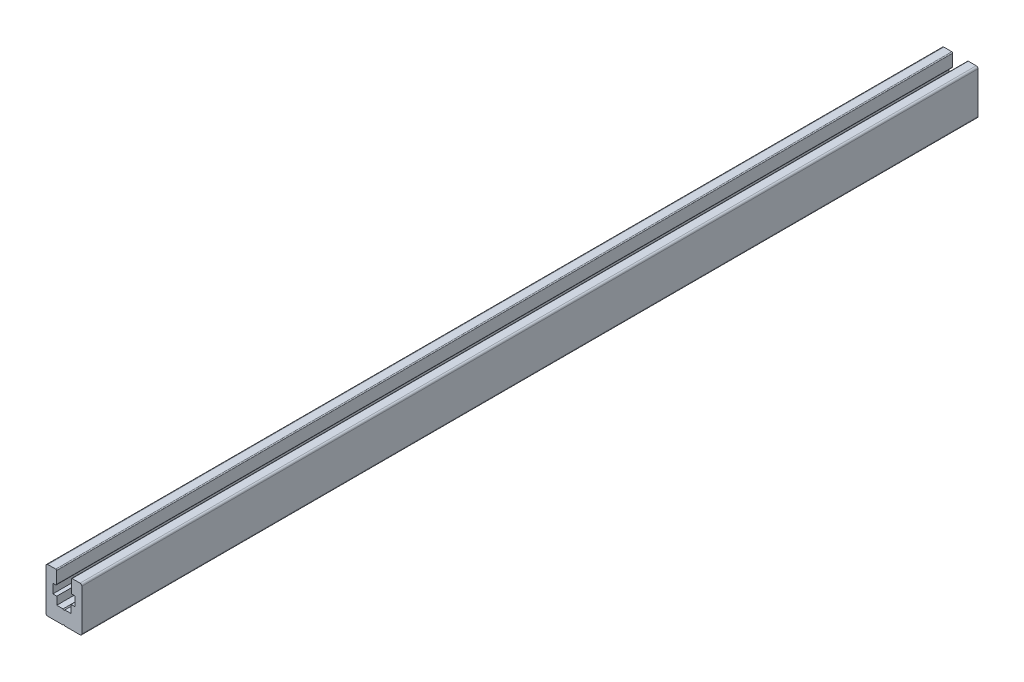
ISO-10303-21;
HEADER;
FILE_DESCRIPTION(('STEP AP214'),'2;1');
FILE_NAME('part.step','',(''),(''),'','','');
FILE_SCHEMA(('AUTOMOTIVE_DESIGN { 1 0 10303 214 1 1 1 1 }'));
ENDSEC;
DATA;
#1=APPLICATION_CONTEXT('core data for automotive mechanical design processes');
#2=APPLICATION_PROTOCOL_DEFINITION('international standard','automotive_design',2000,#1);
#3=PRODUCT_CONTEXT('',#1,'mechanical');
#4=PRODUCT('Part','Part','',(#3));
#5=PRODUCT_RELATED_PRODUCT_CATEGORY('part','',(#4));
#6=PRODUCT_DEFINITION_FORMATION('','',#4);
#7=PRODUCT_DEFINITION_CONTEXT('part definition',#1,'design');
#8=PRODUCT_DEFINITION('design','',#6,#7);
#9=PRODUCT_DEFINITION_SHAPE('','',#8);
#10=(LENGTH_UNIT() NAMED_UNIT(*) SI_UNIT(.MILLI.,.METRE.));
#11=(NAMED_UNIT(*) PLANE_ANGLE_UNIT() SI_UNIT($,.RADIAN.));
#12=(NAMED_UNIT(*) SI_UNIT($,.STERADIAN.) SOLID_ANGLE_UNIT());
#13=UNCERTAINTY_MEASURE_WITH_UNIT(LENGTH_MEASURE(1.E-05),#10,'distance_accuracy_value','');
#14=(GEOMETRIC_REPRESENTATION_CONTEXT(3) GLOBAL_UNCERTAINTY_ASSIGNED_CONTEXT((#13)) GLOBAL_UNIT_ASSIGNED_CONTEXT((#10,
#11,#12)) REPRESENTATION_CONTEXT('',''));
#15=CARTESIAN_POINT('',(0.,0.,0.));
#16=DIRECTION('',(0.,0.,1.));
#17=DIRECTION('',(1.,0.,0.));
#18=AXIS2_PLACEMENT_3D('',#15,#16,#17);
#19=CARTESIAN_POINT('',(-0.5,0.,500.));
#20=DIRECTION('',(0.,-1.,0.));
#21=DIRECTION('',(0.,0.,1.));
#22=AXIS2_PLACEMENT_3D('',#19,#20,#21);
#23=PLANE('',#22);
#24=DIRECTION('',(-1.,0.,0.));
#25=VECTOR('',#24,1.);
#26=CARTESIAN_POINT('',(-0.5,0.,500.));
#27=LINE('',#26,#25);
#28=CARTESIAN_POINT('',(-0.5,0.,500.));
#29=VERTEX_POINT('',#28);
#30=CARTESIAN_POINT('',(-9.,0.,500.));
#31=VERTEX_POINT('',#30);
#32=EDGE_CURVE('E285',#29,#31,#27,.T.);
#33=ORIENTED_EDGE('',*,*,#32,.T.);
#34=DIRECTION('',(0.,0.,-1.));
#35=VECTOR('',#34,1.);
#36=CARTESIAN_POINT('',(-9.,0.,500.));
#37=LINE('',#36,#35);
#38=CARTESIAN_POINT('',(-9.,0.,0.));
#39=VERTEX_POINT('',#38);
#40=EDGE_CURVE('E406',#31,#39,#37,.T.);
#41=ORIENTED_EDGE('',*,*,#40,.T.);
#42=DIRECTION('',(-1.,0.,0.));
#43=VECTOR('',#42,1.);
#44=CARTESIAN_POINT('',(-0.5,0.,0.));
#45=LINE('',#44,#43);
#46=CARTESIAN_POINT('',(-0.5,0.,0.));
#47=VERTEX_POINT('',#46);
#48=EDGE_CURVE('E534',#47,#39,#45,.T.);
#49=ORIENTED_EDGE('',*,*,#48,.F.);
#50=DIRECTION('',(0.,0.,-1.));
#51=VECTOR('',#50,1.);
#52=CARTESIAN_POINT('',(-0.5,0.,500.));
#53=LINE('',#52,#51);
#54=EDGE_CURVE('E344',#29,#47,#53,.T.);
#55=ORIENTED_EDGE('',*,*,#54,.F.);
#56=EDGE_LOOP('',(#33,#41,#49,#55));
#57=FACE_BOUND('',#56,.T.);
#58=ADVANCED_FACE('F14',(#57),#23,.T.);
#59=CARTESIAN_POINT('',(0.,0.5,500.));
#60=DIRECTION('',(0.707106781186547,-0.707106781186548,0.));
#61=DIRECTION('',(-0.707106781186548,-0.707106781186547,0.));
#62=AXIS2_PLACEMENT_3D('',#59,#60,#61);
#63=PLANE('',#62);
#64=DIRECTION('',(-0.707106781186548,-0.707106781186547,0.));
#65=VECTOR('',#64,1.);
#66=CARTESIAN_POINT('',(0.,0.5,0.));
#67=LINE('',#66,#65);
#68=CARTESIAN_POINT('',(0.,0.5,0.));
#69=VERTEX_POINT('',#68);
#70=EDGE_CURVE('E282',#69,#47,#67,.T.);
#71=ORIENTED_EDGE('',*,*,#70,.F.);
#72=DIRECTION('',(0.,0.,-1.));
#73=VECTOR('',#72,1.);
#74=CARTESIAN_POINT('',(0.,0.5,500.));
#75=LINE('',#74,#73);
#76=CARTESIAN_POINT('',(0.,0.5,500.));
#77=VERTEX_POINT('',#76);
#78=EDGE_CURVE('E347',#77,#69,#75,.T.);
#79=ORIENTED_EDGE('',*,*,#78,.F.);
#80=DIRECTION('',(-0.707106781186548,-0.707106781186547,0.));
#81=VECTOR('',#80,1.);
#82=CARTESIAN_POINT('',(0.,0.5,500.));
#83=LINE('',#82,#81);
#84=EDGE_CURVE('E232',#77,#29,#83,.T.);
#85=ORIENTED_EDGE('',*,*,#84,.T.);
#86=ORIENTED_EDGE('',*,*,#54,.T.);
#87=EDGE_LOOP('',(#71,#79,#85,#86));
#88=FACE_BOUND('',#87,.T.);
#89=ADVANCED_FACE('F514',(#88),#63,.T.);
#90=CARTESIAN_POINT('',(0.,0.5,500.));
#91=DIRECTION('',(-0.707106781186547,-0.707106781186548,0.));
#92=DIRECTION('',(-0.707106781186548,0.707106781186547,0.));
#93=AXIS2_PLACEMENT_3D('',#90,#91,#92);
#94=PLANE('',#93);
#95=DIRECTION('',(-0.707106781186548,0.707106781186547,0.));
#96=VECTOR('',#95,1.);
#97=CARTESIAN_POINT('',(0.,0.5,0.));
#98=LINE('',#97,#96);
#99=CARTESIAN_POINT('',(0.5,0.,0.));
#100=VERTEX_POINT('',#99);
#101=EDGE_CURVE('E279',#100,#69,#98,.T.);
#102=ORIENTED_EDGE('',*,*,#101,.F.);
#103=DIRECTION('',(0.,0.,-1.));
#104=VECTOR('',#103,1.);
#105=CARTESIAN_POINT('',(0.5,0.,500.));
#106=LINE('',#105,#104);
#107=CARTESIAN_POINT('',(0.5,0.,500.));
#108=VERTEX_POINT('',#107);
#109=EDGE_CURVE('E349',#108,#100,#106,.T.);
#110=ORIENTED_EDGE('',*,*,#109,.F.);
#111=DIRECTION('',(-0.707106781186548,0.707106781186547,0.));
#112=VECTOR('',#111,1.);
#113=CARTESIAN_POINT('',(0.,0.5,500.));
#114=LINE('',#113,#112);
#115=EDGE_CURVE('E339',#108,#77,#114,.T.);
#116=ORIENTED_EDGE('',*,*,#115,.T.);
#117=ORIENTED_EDGE('',*,*,#78,.T.);
#118=EDGE_LOOP('',(#102,#110,#116,#117));
#119=FACE_BOUND('',#118,.T.);
#120=ADVANCED_FACE('F520',(#119),#94,.T.);
#121=CARTESIAN_POINT('',(10.,0.,500.));
#122=DIRECTION('',(0.,-1.,0.));
#123=DIRECTION('',(-1.,0.,0.));
#124=AXIS2_PLACEMENT_3D('',#121,#122,#123);
#125=PLANE('',#124);
#126=DIRECTION('',(-1.,0.,0.));
#127=VECTOR('',#126,1.);
#128=CARTESIAN_POINT('',(10.,0.,0.));
#129=LINE('',#128,#127);
#130=CARTESIAN_POINT('',(9.,0.,0.));
#131=VERTEX_POINT('',#130);
#132=EDGE_CURVE('E277',#131,#100,#129,.T.);
#133=ORIENTED_EDGE('',*,*,#132,.F.);
#134=DIRECTION('',(0.,0.,-1.));
#135=VECTOR('',#134,1.);
#136=CARTESIAN_POINT('',(9.,0.,500.));
#137=LINE('',#136,#135);
#138=CARTESIAN_POINT('',(9.,0.,500.));
#139=VERTEX_POINT('',#138);
#140=EDGE_CURVE('E9',#131,#139,#137,.F.);
#141=ORIENTED_EDGE('',*,*,#140,.T.);
#142=DIRECTION('',(-1.,0.,0.));
#143=VECTOR('',#142,1.);
#144=CARTESIAN_POINT('',(10.,0.,500.));
#145=LINE('',#144,#143);
#146=EDGE_CURVE('E337',#139,#108,#145,.T.);
#147=ORIENTED_EDGE('',*,*,#146,.T.);
#148=ORIENTED_EDGE('',*,*,#109,.T.);
#149=EDGE_LOOP('',(#133,#141,#147,#148));
#150=FACE_BOUND('',#149,.T.);
#151=ADVANCED_FACE('F580',(#150),#125,.T.);
#152=CARTESIAN_POINT('',(10.,0.,500.));
#153=DIRECTION('',(1.,0.,0.));
#154=DIRECTION('',(0.,0.,-1.));
#155=AXIS2_PLACEMENT_3D('',#152,#153,#154);
#156=PLANE('',#155);
#157=DIRECTION('',(0.,-1.,0.));
#158=VECTOR('',#157,1.);
#159=CARTESIAN_POINT('',(10.,0.,0.));
#160=LINE('',#159,#158);
#161=CARTESIAN_POINT('',(10.,24.,0.));
#162=VERTEX_POINT('',#161);
#163=CARTESIAN_POINT('',(10.,1.,0.));
#164=VERTEX_POINT('',#163);
#165=EDGE_CURVE('E274',#162,#164,#160,.T.);
#166=ORIENTED_EDGE('',*,*,#165,.F.);
#167=DIRECTION('',(0.,0.,-1.));
#168=VECTOR('',#167,1.);
#169=CARTESIAN_POINT('',(10.,24.,500.));
#170=LINE('',#169,#168);
#171=CARTESIAN_POINT('',(10.,24.,500.));
#172=VERTEX_POINT('',#171);
#173=EDGE_CURVE('E21',#162,#172,#170,.F.);
#174=ORIENTED_EDGE('',*,*,#173,.T.);
#175=DIRECTION('',(0.,-1.,0.));
#176=VECTOR('',#175,1.);
#177=CARTESIAN_POINT('',(10.,0.,500.));
#178=LINE('',#177,#176);
#179=CARTESIAN_POINT('',(10.,1.,500.));
#180=VERTEX_POINT('',#179);
#181=EDGE_CURVE('E335',#172,#180,#178,.T.);
#182=ORIENTED_EDGE('',*,*,#181,.T.);
#183=DIRECTION('',(0.,0.,-1.));
#184=VECTOR('',#183,1.);
#185=CARTESIAN_POINT('',(10.,1.,500.));
#186=LINE('',#185,#184);
#187=EDGE_CURVE('E434',#180,#164,#186,.T.);
#188=ORIENTED_EDGE('',*,*,#187,.T.);
#189=EDGE_LOOP('',(#166,#174,#182,#188));
#190=FACE_BOUND('',#189,.T.);
#191=ADVANCED_FACE('F437',(#190),#156,.T.);
#192=CARTESIAN_POINT('',(10.,25.,500.));
#193=DIRECTION('',(0.,1.,0.));
#194=DIRECTION('',(0.,0.,-1.));
#195=AXIS2_PLACEMENT_3D('',#192,#193,#194);
#196=PLANE('',#195);
#197=DIRECTION('',(1.,0.,0.));
#198=VECTOR('',#197,1.);
#199=CARTESIAN_POINT('',(10.,25.,500.));
#200=LINE('',#199,#198);
#201=CARTESIAN_POINT('',(4.6,25.,500.));
#202=VERTEX_POINT('',#201);
#203=CARTESIAN_POINT('',(9.,25.,500.));
#204=VERTEX_POINT('',#203);
#205=EDGE_CURVE('E332',#202,#204,#200,.T.);
#206=ORIENTED_EDGE('',*,*,#205,.T.);
#207=DIRECTION('',(0.,0.,-1.));
#208=VECTOR('',#207,1.);
#209=CARTESIAN_POINT('',(9.,25.,500.));
#210=LINE('',#209,#208);
#211=CARTESIAN_POINT('',(9.,25.,0.));
#212=VERTEX_POINT('',#211);
#213=EDGE_CURVE('E431',#204,#212,#210,.T.);
#214=ORIENTED_EDGE('',*,*,#213,.T.);
#215=DIRECTION('',(1.,0.,0.));
#216=VECTOR('',#215,1.);
#217=CARTESIAN_POINT('',(10.,25.,0.));
#218=LINE('',#217,#216);
#219=CARTESIAN_POINT('',(4.6,25.,0.));
#220=VERTEX_POINT('',#219);
#221=EDGE_CURVE('E271',#220,#212,#218,.T.);
#222=ORIENTED_EDGE('',*,*,#221,.F.);
#223=DIRECTION('',(0.,0.,-1.));
#224=VECTOR('',#223,1.);
#225=CARTESIAN_POINT('',(4.6,25.,500.));
#226=LINE('',#225,#224);
#227=EDGE_CURVE('E382',#220,#202,#226,.F.);
#228=ORIENTED_EDGE('',*,*,#227,.T.);
#229=EDGE_LOOP('',(#206,#214,#222,#228));
#230=FACE_BOUND('',#229,.T.);
#231=ADVANCED_FACE('F446',(#230),#196,.T.);
#232=CARTESIAN_POINT('',(4.1,25.,500.));
#233=DIRECTION('',(-1.,0.,0.));
#234=DIRECTION('',(0.,1.,0.));
#235=AXIS2_PLACEMENT_3D('',#232,#233,#234);
#236=PLANE('',#235);
#237=DIRECTION('',(0.,1.,0.));
#238=VECTOR('',#237,1.);
#239=CARTESIAN_POINT('',(4.1,25.,500.));
#240=LINE('',#239,#238);
#241=CARTESIAN_POINT('',(4.1,17.9,500.));
#242=VERTEX_POINT('',#241);
#243=CARTESIAN_POINT('',(4.1,24.5,500.));
#244=VERTEX_POINT('',#243);
#245=EDGE_CURVE('E329',#242,#244,#240,.T.);
#246=ORIENTED_EDGE('',*,*,#245,.T.);
#247=DIRECTION('',(0.,0.,-1.));
#248=VECTOR('',#247,1.);
#249=CARTESIAN_POINT('',(4.1,24.5,500.));
#250=LINE('',#249,#248);
#251=CARTESIAN_POINT('',(4.1,24.5,0.));
#252=VERTEX_POINT('',#251);
#253=EDGE_CURVE('E372',#244,#252,#250,.T.);
#254=ORIENTED_EDGE('',*,*,#253,.T.);
#255=DIRECTION('',(0.,1.,0.));
#256=VECTOR('',#255,1.);
#257=CARTESIAN_POINT('',(4.1,25.,0.));
#258=LINE('',#257,#256);
#259=CARTESIAN_POINT('',(4.1,17.9,0.));
#260=VERTEX_POINT('',#259);
#261=EDGE_CURVE('E268',#260,#252,#258,.T.);
#262=ORIENTED_EDGE('',*,*,#261,.F.);
#263=DIRECTION('',(0.,0.,-1.));
#264=VECTOR('',#263,1.);
#265=CARTESIAN_POINT('',(4.1,17.9,500.));
#266=LINE('',#265,#264);
#267=EDGE_CURVE('E346',#260,#242,#266,.F.);
#268=ORIENTED_EDGE('',*,*,#267,.T.);
#269=EDGE_LOOP('',(#246,#254,#262,#268));
#270=FACE_BOUND('',#269,.T.);
#271=ADVANCED_FACE('F458',(#270),#236,.T.);
#272=CARTESIAN_POINT('',(4.1,17.4,500.));
#273=DIRECTION('',(0.,-1.,0.));
#274=DIRECTION('',(-1.,0.,0.));
#275=AXIS2_PLACEMENT_3D('',#272,#273,#274);
#276=PLANE('',#275);
#277=DIRECTION('',(-1.,0.,0.));
#278=VECTOR('',#277,1.);
#279=CARTESIAN_POINT('',(4.1,17.4,500.));
#280=LINE('',#279,#278);
#281=CARTESIAN_POINT('',(6.2,17.4,500.));
#282=VERTEX_POINT('',#281);
#283=CARTESIAN_POINT('',(4.6,17.4,500.));
#284=VERTEX_POINT('',#283);
#285=EDGE_CURVE('E326',#282,#284,#280,.T.);
#286=ORIENTED_EDGE('',*,*,#285,.T.);
#287=DIRECTION('',(0.,0.,-1.));
#288=VECTOR('',#287,1.);
#289=CARTESIAN_POINT('',(4.6,17.4,500.));
#290=LINE('',#289,#288);
#291=CARTESIAN_POINT('',(4.6,17.4,0.));
#292=VERTEX_POINT('',#291);
#293=EDGE_CURVE('E393',#284,#292,#290,.T.);
#294=ORIENTED_EDGE('',*,*,#293,.T.);
#295=DIRECTION('',(-1.,0.,0.));
#296=VECTOR('',#295,1.);
#297=CARTESIAN_POINT('',(4.1,17.4,0.));
#298=LINE('',#297,#296);
#299=CARTESIAN_POINT('',(6.2,17.4,0.));
#300=VERTEX_POINT('',#299);
#301=EDGE_CURVE('E265',#300,#292,#298,.T.);
#302=ORIENTED_EDGE('',*,*,#301,.F.);
#303=DIRECTION('',(0.,0.,-1.));
#304=VECTOR('',#303,1.);
#305=CARTESIAN_POINT('',(6.2,17.4,500.));
#306=LINE('',#305,#304);
#307=EDGE_CURVE('E352',#282,#300,#306,.T.);
#308=ORIENTED_EDGE('',*,*,#307,.F.);
#309=EDGE_LOOP('',(#286,#294,#302,#308));
#310=FACE_BOUND('',#309,.T.);
#311=ADVANCED_FACE('F466',(#310),#276,.T.);
#312=CARTESIAN_POINT('',(6.2,17.4,500.));
#313=DIRECTION('',(-1.,0.,0.));
#314=DIRECTION('',(0.,1.,0.));
#315=AXIS2_PLACEMENT_3D('',#312,#313,#314);
#316=PLANE('',#315);
#317=DIRECTION('',(0.,1.,0.));
#318=VECTOR('',#317,1.);
#319=CARTESIAN_POINT('',(6.2,17.4,0.));
#320=LINE('',#319,#318);
#321=CARTESIAN_POINT('',(6.2,12.2,0.));
#322=VERTEX_POINT('',#321);
#323=EDGE_CURVE('E262',#322,#300,#320,.T.);
#324=ORIENTED_EDGE('',*,*,#323,.F.);
#325=DIRECTION('',(0.,0.,-1.));
#326=VECTOR('',#325,1.);
#327=CARTESIAN_POINT('',(6.2,12.2,500.));
#328=LINE('',#327,#326);
#329=CARTESIAN_POINT('',(6.2,12.2,500.));
#330=VERTEX_POINT('',#329);
#331=EDGE_CURVE('E354',#330,#322,#328,.T.);
#332=ORIENTED_EDGE('',*,*,#331,.F.);
#333=DIRECTION('',(0.,1.,0.));
#334=VECTOR('',#333,1.);
#335=CARTESIAN_POINT('',(6.2,17.4,500.));
#336=LINE('',#335,#334);
#337=EDGE_CURVE('E323',#330,#282,#336,.T.);
#338=ORIENTED_EDGE('',*,*,#337,.T.);
#339=ORIENTED_EDGE('',*,*,#307,.T.);
#340=EDGE_LOOP('',(#324,#332,#338,#339));
#341=FACE_BOUND('',#340,.T.);
#342=ADVANCED_FACE('F472',(#341),#316,.T.);
#343=CARTESIAN_POINT('',(6.2,12.2,500.));
#344=DIRECTION('',(0.,1.,0.));
#345=DIRECTION('',(1.,0.,0.));
#346=AXIS2_PLACEMENT_3D('',#343,#344,#345);
#347=PLANE('',#346);
#348=DIRECTION('',(1.,0.,0.));
#349=VECTOR('',#348,1.);
#350=CARTESIAN_POINT('',(6.2,12.2,0.));
#351=LINE('',#350,#349);
#352=CARTESIAN_POINT('',(4.,12.2,0.));
#353=VERTEX_POINT('',#352);
#354=EDGE_CURVE('E259',#353,#322,#351,.T.);
#355=ORIENTED_EDGE('',*,*,#354,.F.);
#356=DIRECTION('',(0.,0.,-1.));
#357=VECTOR('',#356,1.);
#358=CARTESIAN_POINT('',(4.,12.2,500.));
#359=LINE('',#358,#357);
#360=CARTESIAN_POINT('',(4.,12.2,500.));
#361=VERTEX_POINT('',#360);
#362=EDGE_CURVE('E356',#361,#353,#359,.T.);
#363=ORIENTED_EDGE('',*,*,#362,.F.);
#364=DIRECTION('',(1.,0.,0.));
#365=VECTOR('',#364,1.);
#366=CARTESIAN_POINT('',(6.2,12.2,500.));
#367=LINE('',#366,#365);
#368=EDGE_CURVE('E320',#361,#330,#367,.T.);
#369=ORIENTED_EDGE('',*,*,#368,.T.);
#370=ORIENTED_EDGE('',*,*,#331,.T.);
#371=EDGE_LOOP('',(#355,#363,#369,#370));
#372=FACE_BOUND('',#371,.T.);
#373=ADVANCED_FACE('F475',(#372),#347,.T.);
#374=CARTESIAN_POINT('',(4.,12.2,500.));
#375=DIRECTION('',(-1.,0.,0.));
#376=DIRECTION('',(0.,1.,0.));
#377=AXIS2_PLACEMENT_3D('',#374,#375,#376);
#378=PLANE('',#377);
#379=DIRECTION('',(0.,1.,0.));
#380=VECTOR('',#379,1.);
#381=CARTESIAN_POINT('',(4.,12.2,0.));
#382=LINE('',#381,#380);
#383=CARTESIAN_POINT('',(4.,7.8,0.));
#384=VERTEX_POINT('',#383);
#385=EDGE_CURVE('E256',#384,#353,#382,.T.);
#386=ORIENTED_EDGE('',*,*,#385,.F.);
#387=DIRECTION('',(0.,0.,-1.));
#388=VECTOR('',#387,1.);
#389=CARTESIAN_POINT('',(4.,7.8,500.));
#390=LINE('',#389,#388);
#391=CARTESIAN_POINT('',(4.,7.8,500.));
#392=VERTEX_POINT('',#391);
#393=EDGE_CURVE('E358',#392,#384,#390,.T.);
#394=ORIENTED_EDGE('',*,*,#393,.F.);
#395=DIRECTION('',(0.,1.,0.));
#396=VECTOR('',#395,1.);
#397=CARTESIAN_POINT('',(4.,12.2,500.));
#398=LINE('',#397,#396);
#399=EDGE_CURVE('E317',#392,#361,#398,.T.);
#400=ORIENTED_EDGE('',*,*,#399,.T.);
#401=ORIENTED_EDGE('',*,*,#362,.T.);
#402=EDGE_LOOP('',(#386,#394,#400,#401));
#403=FACE_BOUND('',#402,.T.);
#404=ADVANCED_FACE('F480',(#403),#378,.T.);
#405=CARTESIAN_POINT('',(0.5,7.8,500.));
#406=DIRECTION('',(0.,1.,0.));
#407=DIRECTION('',(1.,0.,0.));
#408=AXIS2_PLACEMENT_3D('',#405,#406,#407);
#409=PLANE('',#408);
#410=DIRECTION('',(1.,0.,0.));
#411=VECTOR('',#410,1.);
#412=CARTESIAN_POINT('',(0.5,7.8,0.));
#413=LINE('',#412,#411);
#414=CARTESIAN_POINT('',(0.5,7.8,0.));
#415=VERTEX_POINT('',#414);
#416=EDGE_CURVE('E253',#415,#384,#413,.T.);
#417=ORIENTED_EDGE('',*,*,#416,.F.);
#418=DIRECTION('',(0.,0.,-1.));
#419=VECTOR('',#418,1.);
#420=CARTESIAN_POINT('',(0.5,7.8,500.));
#421=LINE('',#420,#419);
#422=CARTESIAN_POINT('',(0.5,7.8,500.));
#423=VERTEX_POINT('',#422);
#424=EDGE_CURVE('E360',#423,#415,#421,.T.);
#425=ORIENTED_EDGE('',*,*,#424,.F.);
#426=DIRECTION('',(1.,0.,0.));
#427=VECTOR('',#426,1.);
#428=CARTESIAN_POINT('',(0.5,7.8,500.));
#429=LINE('',#428,#427);
#430=EDGE_CURVE('E314',#423,#392,#429,.T.);
#431=ORIENTED_EDGE('',*,*,#430,.T.);
#432=ORIENTED_EDGE('',*,*,#393,.T.);
#433=EDGE_LOOP('',(#417,#425,#431,#432));
#434=FACE_BOUND('',#433,.T.);
#435=ADVANCED_FACE('F483',(#434),#409,.T.);
#436=CARTESIAN_POINT('',(0.5,7.8,500.));
#437=DIRECTION('',(-0.707106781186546,0.707106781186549,0.));
#438=DIRECTION('',(0.707106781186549,0.707106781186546,0.));
#439=AXIS2_PLACEMENT_3D('',#436,#437,#438);
#440=PLANE('',#439);
#441=DIRECTION('',(0.707106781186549,0.707106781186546,0.));
#442=VECTOR('',#441,1.);
#443=CARTESIAN_POINT('',(0.5,7.8,0.));
#444=LINE('',#443,#442);
#445=CARTESIAN_POINT('',(0.,7.3,0.));
#446=VERTEX_POINT('',#445);
#447=EDGE_CURVE('E250',#446,#415,#444,.T.);
#448=ORIENTED_EDGE('',*,*,#447,.F.);
#449=DIRECTION('',(0.,0.,-1.));
#450=VECTOR('',#449,1.);
#451=CARTESIAN_POINT('',(0.,7.3,500.));
#452=LINE('',#451,#450);
#453=CARTESIAN_POINT('',(0.,7.3,500.));
#454=VERTEX_POINT('',#453);
#455=EDGE_CURVE('E362',#454,#446,#452,.T.);
#456=ORIENTED_EDGE('',*,*,#455,.F.);
#457=DIRECTION('',(0.707106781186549,0.707106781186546,0.));
#458=VECTOR('',#457,1.);
#459=CARTESIAN_POINT('',(0.5,7.8,500.));
#460=LINE('',#459,#458);
#461=EDGE_CURVE('E311',#454,#423,#460,.T.);
#462=ORIENTED_EDGE('',*,*,#461,.T.);
#463=ORIENTED_EDGE('',*,*,#424,.T.);
#464=EDGE_LOOP('',(#448,#456,#462,#463));
#465=FACE_BOUND('',#464,.T.);
#466=ADVANCED_FACE('F488',(#465),#440,.T.);
#467=CARTESIAN_POINT('',(-0.5,7.8,500.));
#468=DIRECTION('',(0.707106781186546,0.707106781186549,0.));
#469=DIRECTION('',(0.707106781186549,-0.707106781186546,0.));
#470=AXIS2_PLACEMENT_3D('',#467,#468,#469);
#471=PLANE('',#470);
#472=DIRECTION('',(0.707106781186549,-0.707106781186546,0.));
#473=VECTOR('',#472,1.);
#474=CARTESIAN_POINT('',(-0.5,7.8,0.));
#475=LINE('',#474,#473);
#476=CARTESIAN_POINT('',(-0.5,7.8,0.));
#477=VERTEX_POINT('',#476);
#478=EDGE_CURVE('E247',#477,#446,#475,.T.);
#479=ORIENTED_EDGE('',*,*,#478,.F.);
#480=DIRECTION('',(0.,0.,-1.));
#481=VECTOR('',#480,1.);
#482=CARTESIAN_POINT('',(-0.5,7.8,500.));
#483=LINE('',#482,#481);
#484=CARTESIAN_POINT('',(-0.5,7.8,500.));
#485=VERTEX_POINT('',#484);
#486=EDGE_CURVE('E364',#485,#477,#483,.T.);
#487=ORIENTED_EDGE('',*,*,#486,.F.);
#488=DIRECTION('',(0.707106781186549,-0.707106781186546,0.));
#489=VECTOR('',#488,1.);
#490=CARTESIAN_POINT('',(-0.5,7.8,500.));
#491=LINE('',#490,#489);
#492=EDGE_CURVE('E308',#485,#454,#491,.T.);
#493=ORIENTED_EDGE('',*,*,#492,.T.);
#494=ORIENTED_EDGE('',*,*,#455,.T.);
#495=EDGE_LOOP('',(#479,#487,#493,#494));
#496=FACE_BOUND('',#495,.T.);
#497=ADVANCED_FACE('F491',(#496),#471,.T.);
#498=CARTESIAN_POINT('',(-4.,7.8,500.));
#499=DIRECTION('',(0.,1.,0.));
#500=DIRECTION('',(1.,0.,0.));
#501=AXIS2_PLACEMENT_3D('',#498,#499,#500);
#502=PLANE('',#501);
#503=DIRECTION('',(1.,0.,0.));
#504=VECTOR('',#503,1.);
#505=CARTESIAN_POINT('',(-4.,7.8,0.));
#506=LINE('',#505,#504);
#507=CARTESIAN_POINT('',(-4.,7.8,0.));
#508=VERTEX_POINT('',#507);
#509=EDGE_CURVE('E244',#508,#477,#506,.T.);
#510=ORIENTED_EDGE('',*,*,#509,.F.);
#511=DIRECTION('',(0.,0.,-1.));
#512=VECTOR('',#511,1.);
#513=CARTESIAN_POINT('',(-4.,7.8,500.));
#514=LINE('',#513,#512);
#515=CARTESIAN_POINT('',(-4.,7.8,500.));
#516=VERTEX_POINT('',#515);
#517=EDGE_CURVE('E366',#516,#508,#514,.T.);
#518=ORIENTED_EDGE('',*,*,#517,.F.);
#519=DIRECTION('',(1.,0.,0.));
#520=VECTOR('',#519,1.);
#521=CARTESIAN_POINT('',(-4.,7.8,500.));
#522=LINE('',#521,#520);
#523=EDGE_CURVE('E305',#516,#485,#522,.T.);
#524=ORIENTED_EDGE('',*,*,#523,.T.);
#525=ORIENTED_EDGE('',*,*,#486,.T.);
#526=EDGE_LOOP('',(#510,#518,#524,#525));
#527=FACE_BOUND('',#526,.T.);
#528=ADVANCED_FACE('F496',(#527),#502,.T.);
#529=CARTESIAN_POINT('',(-4.,12.2,500.));
#530=DIRECTION('',(1.,0.,0.));
#531=DIRECTION('',(0.,-1.,0.));
#532=AXIS2_PLACEMENT_3D('',#529,#530,#531);
#533=PLANE('',#532);
#534=DIRECTION('',(0.,-1.,0.));
#535=VECTOR('',#534,1.);
#536=CARTESIAN_POINT('',(-4.,12.2,0.));
#537=LINE('',#536,#535);
#538=CARTESIAN_POINT('',(-4.,12.2,0.));
#539=VERTEX_POINT('',#538);
#540=EDGE_CURVE('E238',#539,#508,#537,.T.);
#541=ORIENTED_EDGE('',*,*,#540,.F.);
#542=DIRECTION('',(0.,0.,-1.));
#543=VECTOR('',#542,1.);
#544=CARTESIAN_POINT('',(-4.,12.2,500.));
#545=LINE('',#544,#543);
#546=CARTESIAN_POINT('',(-4.,12.2,500.));
#547=VERTEX_POINT('',#546);
#548=EDGE_CURVE('E368',#547,#539,#545,.T.);
#549=ORIENTED_EDGE('',*,*,#548,.F.);
#550=DIRECTION('',(0.,-1.,0.));
#551=VECTOR('',#550,1.);
#552=CARTESIAN_POINT('',(-4.,12.2,500.));
#553=LINE('',#552,#551);
#554=EDGE_CURVE('E302',#547,#516,#553,.T.);
#555=ORIENTED_EDGE('',*,*,#554,.T.);
#556=ORIENTED_EDGE('',*,*,#517,.T.);
#557=EDGE_LOOP('',(#541,#549,#555,#556));
#558=FACE_BOUND('',#557,.T.);
#559=ADVANCED_FACE('F499',(#558),#533,.T.);
#560=CARTESIAN_POINT('',(-6.2,12.2,500.));
#561=DIRECTION('',(0.,1.,0.));
#562=DIRECTION('',(1.,0.,0.));
#563=AXIS2_PLACEMENT_3D('',#560,#561,#562);
#564=PLANE('',#563);
#565=DIRECTION('',(1.,0.,0.));
#566=VECTOR('',#565,1.);
#567=CARTESIAN_POINT('',(-6.2,12.2,0.));
#568=LINE('',#567,#566);
#569=CARTESIAN_POINT('',(-6.2,12.2,0.));
#570=VERTEX_POINT('',#569);
#571=EDGE_CURVE('E236',#570,#539,#568,.T.);
#572=ORIENTED_EDGE('',*,*,#571,.F.);
#573=DIRECTION('',(0.,0.,-1.));
#574=VECTOR('',#573,1.);
#575=CARTESIAN_POINT('',(-6.2,12.2,500.));
#576=LINE('',#575,#574);
#577=CARTESIAN_POINT('',(-6.2,12.2,500.));
#578=VERTEX_POINT('',#577);
#579=EDGE_CURVE('E231',#578,#570,#576,.T.);
#580=ORIENTED_EDGE('',*,*,#579,.F.);
#581=DIRECTION('',(1.,0.,0.));
#582=VECTOR('',#581,1.);
#583=CARTESIAN_POINT('',(-6.2,12.2,500.));
#584=LINE('',#583,#582);
#585=EDGE_CURVE('E299',#578,#547,#584,.T.);
#586=ORIENTED_EDGE('',*,*,#585,.T.);
#587=ORIENTED_EDGE('',*,*,#548,.T.);
#588=EDGE_LOOP('',(#572,#580,#586,#587));
#589=FACE_BOUND('',#588,.T.);
#590=ADVANCED_FACE('F502',(#589),#564,.T.);
#591=CARTESIAN_POINT('',(-6.2,17.4,500.));
#592=DIRECTION('',(1.,0.,0.));
#593=DIRECTION('',(0.,-1.,0.));
#594=AXIS2_PLACEMENT_3D('',#591,#592,#593);
#595=PLANE('',#594);
#596=DIRECTION('',(0.,-1.,0.));
#597=VECTOR('',#596,1.);
#598=CARTESIAN_POINT('',(-6.2,17.4,0.));
#599=LINE('',#598,#597);
#600=CARTESIAN_POINT('',(-6.2,17.4,0.));
#601=VERTEX_POINT('',#600);
#602=EDGE_CURVE('E216',#601,#570,#599,.T.);
#603=ORIENTED_EDGE('',*,*,#602,.F.);
#604=DIRECTION('',(0.,0.,-1.));
#605=VECTOR('',#604,1.);
#606=CARTESIAN_POINT('',(-6.2,17.4,500.));
#607=LINE('',#606,#605);
#608=CARTESIAN_POINT('',(-6.2,17.4,500.));
#609=VERTEX_POINT('',#608);
#610=EDGE_CURVE('E224',#609,#601,#607,.T.);
#611=ORIENTED_EDGE('',*,*,#610,.F.);
#612=DIRECTION('',(0.,-1.,0.));
#613=VECTOR('',#612,1.);
#614=CARTESIAN_POINT('',(-6.2,17.4,500.));
#615=LINE('',#614,#613);
#616=EDGE_CURVE('E297',#609,#578,#615,.T.);
#617=ORIENTED_EDGE('',*,*,#616,.T.);
#618=ORIENTED_EDGE('',*,*,#579,.T.);
#619=EDGE_LOOP('',(#603,#611,#617,#618));
#620=FACE_BOUND('',#619,.T.);
#621=ADVANCED_FACE('F234',(#620),#595,.T.);
#622=CARTESIAN_POINT('',(-4.1,17.4,500.));
#623=DIRECTION('',(0.,-1.,0.));
#624=DIRECTION('',(0.,0.,1.));
#625=AXIS2_PLACEMENT_3D('',#622,#623,#624);
#626=PLANE('',#625);
#627=DIRECTION('',(-1.,0.,0.));
#628=VECTOR('',#627,1.);
#629=CARTESIAN_POINT('',(-4.1,17.4,0.));
#630=LINE('',#629,#628);
#631=CARTESIAN_POINT('',(-4.6,17.4,0.));
#632=VERTEX_POINT('',#631);
#633=EDGE_CURVE('E210',#632,#601,#630,.T.);
#634=ORIENTED_EDGE('',*,*,#633,.F.);
#635=DIRECTION('',(0.,0.,-1.));
#636=VECTOR('',#635,1.);
#637=CARTESIAN_POINT('',(-4.6,17.4,500.));
#638=LINE('',#637,#636);
#639=CARTESIAN_POINT('',(-4.6,17.4,500.));
#640=VERTEX_POINT('',#639);
#641=EDGE_CURVE('E404',#632,#640,#638,.F.);
#642=ORIENTED_EDGE('',*,*,#641,.T.);
#643=DIRECTION('',(-1.,0.,0.));
#644=VECTOR('',#643,1.);
#645=CARTESIAN_POINT('',(-4.1,17.4,500.));
#646=LINE('',#645,#644);
#647=EDGE_CURVE('E227',#640,#609,#646,.T.);
#648=ORIENTED_EDGE('',*,*,#647,.T.);
#649=ORIENTED_EDGE('',*,*,#610,.T.);
#650=EDGE_LOOP('',(#634,#642,#648,#649));
#651=FACE_BOUND('',#650,.T.);
#652=ADVANCED_FACE('F225',(#651),#626,.T.);
#653=CARTESIAN_POINT('',(-4.1,25.,500.));
#654=DIRECTION('',(1.,0.,0.));
#655=DIRECTION('',(0.,-1.,0.));
#656=AXIS2_PLACEMENT_3D('',#653,#654,#655);
#657=PLANE('',#656);
#658=DIRECTION('',(0.,-1.,0.));
#659=VECTOR('',#658,1.);
#660=CARTESIAN_POINT('',(-4.1,25.,0.));
#661=LINE('',#660,#659);
#662=CARTESIAN_POINT('',(-4.1,24.5,0.));
#663=VERTEX_POINT('',#662);
#664=CARTESIAN_POINT('',(-4.1,17.9,0.));
#665=VERTEX_POINT('',#664);
#666=EDGE_CURVE('E221',#663,#665,#661,.T.);
#667=ORIENTED_EDGE('',*,*,#666,.F.);
#668=DIRECTION('',(0.,0.,-1.));
#669=VECTOR('',#668,1.);
#670=CARTESIAN_POINT('',(-4.1,24.5,500.));
#671=LINE('',#670,#669);
#672=CARTESIAN_POINT('',(-4.1,24.5,500.));
#673=VERTEX_POINT('',#672);
#674=EDGE_CURVE('E402',#663,#673,#671,.F.);
#675=ORIENTED_EDGE('',*,*,#674,.T.);
#676=DIRECTION('',(0.,-1.,0.));
#677=VECTOR('',#676,1.);
#678=CARTESIAN_POINT('',(-4.1,25.,500.));
#679=LINE('',#678,#677);
#680=CARTESIAN_POINT('',(-4.1,17.9,500.));
#681=VERTEX_POINT('',#680);
#682=EDGE_CURVE('E293',#673,#681,#679,.T.);
#683=ORIENTED_EDGE('',*,*,#682,.T.);
#684=DIRECTION('',(0.,0.,-1.));
#685=VECTOR('',#684,1.);
#686=CARTESIAN_POINT('',(-4.1,17.9,500.));
#687=LINE('',#686,#685);
#688=EDGE_CURVE('E399',#681,#665,#687,.T.);
#689=ORIENTED_EDGE('',*,*,#688,.T.);
#690=EDGE_LOOP('',(#667,#675,#683,#689));
#691=FACE_BOUND('',#690,.T.);
#692=ADVANCED_FACE('F546',(#691),#657,.T.);
#693=CARTESIAN_POINT('',(-10.,25.,500.));
#694=DIRECTION('',(0.,1.,0.));
#695=DIRECTION('',(0.,0.,-1.));
#696=AXIS2_PLACEMENT_3D('',#693,#694,#695);
#697=PLANE('',#696);
#698=DIRECTION('',(1.,0.,0.));
#699=VECTOR('',#698,1.);
#700=CARTESIAN_POINT('',(-10.,25.,0.));
#701=LINE('',#700,#699);
#702=CARTESIAN_POINT('',(-9.,25.,0.));
#703=VERTEX_POINT('',#702);
#704=CARTESIAN_POINT('',(-4.6,25.,0.));
#705=VERTEX_POINT('',#704);
#706=EDGE_CURVE('E538',#703,#705,#701,.T.);
#707=ORIENTED_EDGE('',*,*,#706,.F.);
#708=DIRECTION('',(0.,0.,-1.));
#709=VECTOR('',#708,1.);
#710=CARTESIAN_POINT('',(-9.,25.,500.));
#711=LINE('',#710,#709);
#712=CARTESIAN_POINT('',(-9.,25.,500.));
#713=VERTEX_POINT('',#712);
#714=EDGE_CURVE('E429',#703,#713,#711,.F.);
#715=ORIENTED_EDGE('',*,*,#714,.T.);
#716=DIRECTION('',(1.,0.,0.));
#717=VECTOR('',#716,1.);
#718=CARTESIAN_POINT('',(-10.,25.,500.));
#719=LINE('',#718,#717);
#720=CARTESIAN_POINT('',(-4.6,25.,500.));
#721=VERTEX_POINT('',#720);
#722=EDGE_CURVE('E291',#713,#721,#719,.T.);
#723=ORIENTED_EDGE('',*,*,#722,.T.);
#724=DIRECTION('',(0.,0.,-1.));
#725=VECTOR('',#724,1.);
#726=CARTESIAN_POINT('',(-4.6,25.,500.));
#727=LINE('',#726,#725);
#728=EDGE_CURVE('E396',#721,#705,#727,.T.);
#729=ORIENTED_EDGE('',*,*,#728,.T.);
#730=EDGE_LOOP('',(#707,#715,#723,#729));
#731=FACE_BOUND('',#730,.T.);
#732=ADVANCED_FACE('F758',(#731),#697,.T.);
#733=CARTESIAN_POINT('',(-10.,0.,500.));
#734=DIRECTION('',(-1.,0.,0.));
#735=DIRECTION('',(0.,1.,0.));
#736=AXIS2_PLACEMENT_3D('',#733,#734,#735);
#737=PLANE('',#736);
#738=DIRECTION('',(0.,1.,0.));
#739=VECTOR('',#738,1.);
#740=CARTESIAN_POINT('',(-10.,0.,0.));
#741=LINE('',#740,#739);
#742=CARTESIAN_POINT('',(-10.,1.,0.));
#743=VERTEX_POINT('',#742);
#744=CARTESIAN_POINT('',(-10.,24.,0.));
#745=VERTEX_POINT('',#744);
#746=EDGE_CURVE('E533',#743,#745,#741,.T.);
#747=ORIENTED_EDGE('',*,*,#746,.F.);
#748=DIRECTION('',(0.,0.,-1.));
#749=VECTOR('',#748,1.);
#750=CARTESIAN_POINT('',(-10.,1.,500.));
#751=LINE('',#750,#749);
#752=CARTESIAN_POINT('',(-10.,1.,500.));
#753=VERTEX_POINT('',#752);
#754=EDGE_CURVE('E420',#743,#753,#751,.F.);
#755=ORIENTED_EDGE('',*,*,#754,.T.);
#756=DIRECTION('',(0.,1.,0.));
#757=VECTOR('',#756,1.);
#758=CARTESIAN_POINT('',(-10.,0.,500.));
#759=LINE('',#758,#757);
#760=CARTESIAN_POINT('',(-10.,24.,500.));
#761=VERTEX_POINT('',#760);
#762=EDGE_CURVE('E288',#753,#761,#759,.T.);
#763=ORIENTED_EDGE('',*,*,#762,.T.);
#764=DIRECTION('',(0.,0.,-1.));
#765=VECTOR('',#764,1.);
#766=CARTESIAN_POINT('',(-10.,24.,500.));
#767=LINE('',#766,#765);
#768=EDGE_CURVE('E417',#761,#745,#767,.T.);
#769=ORIENTED_EDGE('',*,*,#768,.T.);
#770=EDGE_LOOP('',(#747,#755,#763,#769));
#771=FACE_BOUND('',#770,.T.);
#772=ADVANCED_FACE('F536',(#771),#737,.T.);
#773=CARTESIAN_POINT('',(10.,0.,500.));
#774=DIRECTION('',(0.,0.,-1.));
#775=DIRECTION('',(-1.,0.,0.));
#776=AXIS2_PLACEMENT_3D('',#773,#774,#775);
#777=PLANE('',#776);
#778=ORIENTED_EDGE('',*,*,#762,.F.);
#779=CARTESIAN_POINT('',(-9.,1.,500.));
#780=DIRECTION('',(0.,0.,-1.));
#781=DIRECTION('',(-1.,0.,0.));
#782=AXIS2_PLACEMENT_3D('',#779,#780,#781);
#783=CIRCLE('',#782,1.);
#784=EDGE_CURVE('E427',#753,#31,#783,.F.);
#785=ORIENTED_EDGE('',*,*,#784,.T.);
#786=ORIENTED_EDGE('',*,*,#32,.F.);
#787=ORIENTED_EDGE('',*,*,#84,.F.);
#788=ORIENTED_EDGE('',*,*,#115,.F.);
#789=ORIENTED_EDGE('',*,*,#146,.F.);
#790=CARTESIAN_POINT('',(9.,1.,500.));
#791=DIRECTION('',(0.,0.,-1.));
#792=DIRECTION('',(-1.,0.,0.));
#793=AXIS2_PLACEMENT_3D('',#790,#791,#792);
#794=CIRCLE('',#793,1.);
#795=EDGE_CURVE('E28',#139,#180,#794,.F.);
#796=ORIENTED_EDGE('',*,*,#795,.T.);
#797=ORIENTED_EDGE('',*,*,#181,.F.);
#798=CARTESIAN_POINT('',(9.,24.,500.));
#799=DIRECTION('',(0.,0.,-1.));
#800=DIRECTION('',(-1.,0.,0.));
#801=AXIS2_PLACEMENT_3D('',#798,#799,#800);
#802=CIRCLE('',#801,1.);
#803=EDGE_CURVE('E423',#172,#204,#802,.F.);
#804=ORIENTED_EDGE('',*,*,#803,.T.);
#805=ORIENTED_EDGE('',*,*,#205,.F.);
#806=CARTESIAN_POINT('',(4.6,24.5,500.));
#807=DIRECTION('',(0.,0.,-1.));
#808=DIRECTION('',(-1.,0.,0.));
#809=AXIS2_PLACEMENT_3D('',#806,#807,#808);
#810=CIRCLE('',#809,0.5);
#811=EDGE_CURVE('E391',#202,#244,#810,.F.);
#812=ORIENTED_EDGE('',*,*,#811,.T.);
#813=ORIENTED_EDGE('',*,*,#245,.F.);
#814=CARTESIAN_POINT('',(4.6,17.9,500.));
#815=DIRECTION('',(0.,0.,-1.));
#816=DIRECTION('',(-1.,0.,0.));
#817=AXIS2_PLACEMENT_3D('',#814,#815,#816);
#818=CIRCLE('',#817,0.5);
#819=EDGE_CURVE('E389',#242,#284,#818,.F.);
#820=ORIENTED_EDGE('',*,*,#819,.T.);
#821=ORIENTED_EDGE('',*,*,#285,.F.);
#822=ORIENTED_EDGE('',*,*,#337,.F.);
#823=ORIENTED_EDGE('',*,*,#368,.F.);
#824=ORIENTED_EDGE('',*,*,#399,.F.);
#825=ORIENTED_EDGE('',*,*,#430,.F.);
#826=ORIENTED_EDGE('',*,*,#461,.F.);
#827=ORIENTED_EDGE('',*,*,#492,.F.);
#828=ORIENTED_EDGE('',*,*,#523,.F.);
#829=ORIENTED_EDGE('',*,*,#554,.F.);
#830=ORIENTED_EDGE('',*,*,#585,.F.);
#831=ORIENTED_EDGE('',*,*,#616,.F.);
#832=ORIENTED_EDGE('',*,*,#647,.F.);
#833=CARTESIAN_POINT('',(-4.6,17.9,500.));
#834=DIRECTION('',(0.,0.,-1.));
#835=DIRECTION('',(-1.,0.,0.));
#836=AXIS2_PLACEMENT_3D('',#833,#834,#835);
#837=CIRCLE('',#836,0.5);
#838=EDGE_CURVE('E384',#640,#681,#837,.F.);
#839=ORIENTED_EDGE('',*,*,#838,.T.);
#840=ORIENTED_EDGE('',*,*,#682,.F.);
#841=CARTESIAN_POINT('',(-4.6,24.5,500.));
#842=DIRECTION('',(0.,0.,-1.));
#843=DIRECTION('',(-1.,0.,0.));
#844=AXIS2_PLACEMENT_3D('',#841,#842,#843);
#845=CIRCLE('',#844,0.5);
#846=EDGE_CURVE('E386',#673,#721,#845,.F.);
#847=ORIENTED_EDGE('',*,*,#846,.T.);
#848=ORIENTED_EDGE('',*,*,#722,.F.);
#849=CARTESIAN_POINT('',(-9.,24.,500.));
#850=DIRECTION('',(0.,0.,-1.));
#851=DIRECTION('',(-1.,0.,0.));
#852=AXIS2_PLACEMENT_3D('',#849,#850,#851);
#853=CIRCLE('',#852,1.);
#854=EDGE_CURVE('E425',#713,#761,#853,.F.);
#855=ORIENTED_EDGE('',*,*,#854,.T.);
#856=EDGE_LOOP('',(#778,#785,#786,#787,#788,#789,#796,#797,#804,#805,#812,#813,#820,#821,#822,
#823,#824,#825,#826,#827,#828,#829,#830,#831,#832,#839,#840,#847,#848,#855));
#857=FACE_BOUND('',#856,.T.);
#858=ADVANCED_FACE('F451',(#857),#777,.F.);
#859=CARTESIAN_POINT('',(10.,0.,0.));
#860=DIRECTION('',(0.,0.,-1.));
#861=DIRECTION('',(-1.,0.,0.));
#862=AXIS2_PLACEMENT_3D('',#859,#860,#861);
#863=PLANE('',#862);
#864=ORIENTED_EDGE('',*,*,#48,.T.);
#865=CARTESIAN_POINT('',(-9.,1.,0.));
#866=DIRECTION('',(0.,0.,-1.));
#867=DIRECTION('',(-1.,0.,0.));
#868=AXIS2_PLACEMENT_3D('',#865,#866,#867);
#869=CIRCLE('',#868,1.);
#870=EDGE_CURVE('E415',#39,#743,#869,.T.);
#871=ORIENTED_EDGE('',*,*,#870,.T.);
#872=ORIENTED_EDGE('',*,*,#746,.T.);
#873=CARTESIAN_POINT('',(-9.,24.,0.));
#874=DIRECTION('',(0.,0.,-1.));
#875=DIRECTION('',(-1.,0.,0.));
#876=AXIS2_PLACEMENT_3D('',#873,#874,#875);
#877=CIRCLE('',#876,1.);
#878=EDGE_CURVE('E413',#745,#703,#877,.T.);
#879=ORIENTED_EDGE('',*,*,#878,.T.);
#880=ORIENTED_EDGE('',*,*,#706,.T.);
#881=CARTESIAN_POINT('',(-4.6,24.5,0.));
#882=DIRECTION('',(0.,0.,-1.));
#883=DIRECTION('',(-1.,0.,0.));
#884=AXIS2_PLACEMENT_3D('',#881,#882,#883);
#885=CIRCLE('',#884,0.5);
#886=EDGE_CURVE('E376',#705,#663,#885,.T.);
#887=ORIENTED_EDGE('',*,*,#886,.T.);
#888=ORIENTED_EDGE('',*,*,#666,.T.);
#889=CARTESIAN_POINT('',(-4.6,17.9,0.));
#890=DIRECTION('',(0.,0.,-1.));
#891=DIRECTION('',(-1.,0.,0.));
#892=AXIS2_PLACEMENT_3D('',#889,#890,#891);
#893=CIRCLE('',#892,0.5);
#894=EDGE_CURVE('E218',#665,#632,#893,.T.);
#895=ORIENTED_EDGE('',*,*,#894,.T.);
#896=ORIENTED_EDGE('',*,*,#633,.T.);
#897=ORIENTED_EDGE('',*,*,#602,.T.);
#898=ORIENTED_EDGE('',*,*,#571,.T.);
#899=ORIENTED_EDGE('',*,*,#540,.T.);
#900=ORIENTED_EDGE('',*,*,#509,.T.);
#901=ORIENTED_EDGE('',*,*,#478,.T.);
#902=ORIENTED_EDGE('',*,*,#447,.T.);
#903=ORIENTED_EDGE('',*,*,#416,.T.);
#904=ORIENTED_EDGE('',*,*,#385,.T.);
#905=ORIENTED_EDGE('',*,*,#354,.T.);
#906=ORIENTED_EDGE('',*,*,#323,.T.);
#907=ORIENTED_EDGE('',*,*,#301,.T.);
#908=CARTESIAN_POINT('',(4.6,17.9,0.));
#909=DIRECTION('',(0.,0.,-1.));
#910=DIRECTION('',(-1.,0.,0.));
#911=AXIS2_PLACEMENT_3D('',#908,#909,#910);
#912=CIRCLE('',#911,0.5);
#913=EDGE_CURVE('E378',#292,#260,#912,.T.);
#914=ORIENTED_EDGE('',*,*,#913,.T.);
#915=ORIENTED_EDGE('',*,*,#261,.T.);
#916=CARTESIAN_POINT('',(4.6,24.5,0.));
#917=DIRECTION('',(0.,0.,-1.));
#918=DIRECTION('',(-1.,0.,0.));
#919=AXIS2_PLACEMENT_3D('',#916,#917,#918);
#920=CIRCLE('',#919,0.5);
#921=EDGE_CURVE('E380',#252,#220,#920,.T.);
#922=ORIENTED_EDGE('',*,*,#921,.T.);
#923=ORIENTED_EDGE('',*,*,#221,.T.);
#924=CARTESIAN_POINT('',(9.,24.,0.));
#925=DIRECTION('',(0.,0.,-1.));
#926=DIRECTION('',(-1.,0.,0.));
#927=AXIS2_PLACEMENT_3D('',#924,#925,#926);
#928=CIRCLE('',#927,1.);
#929=EDGE_CURVE('E411',#212,#162,#928,.T.);
#930=ORIENTED_EDGE('',*,*,#929,.T.);
#931=ORIENTED_EDGE('',*,*,#165,.T.);
#932=CARTESIAN_POINT('',(9.,1.,0.));
#933=DIRECTION('',(0.,0.,-1.));
#934=DIRECTION('',(-1.,0.,0.));
#935=AXIS2_PLACEMENT_3D('',#932,#933,#934);
#936=CIRCLE('',#935,1.);
#937=EDGE_CURVE('E409',#164,#131,#936,.T.);
#938=ORIENTED_EDGE('',*,*,#937,.T.);
#939=ORIENTED_EDGE('',*,*,#132,.T.);
#940=ORIENTED_EDGE('',*,*,#101,.T.);
#941=ORIENTED_EDGE('',*,*,#70,.T.);
#942=EDGE_LOOP('',(#864,#871,#872,#879,#880,#887,#888,#895,#896,#897,#898,#899,#900,#901,#902,
#903,#904,#905,#906,#907,#914,#915,#922,#923,#930,#931,#938,#939,#940,#941));
#943=FACE_BOUND('',#942,.T.);
#944=ADVANCED_FACE('F213',(#943),#863,.T.);
#945=CARTESIAN_POINT('',(4.6,24.5,500.));
#946=DIRECTION('',(0.,0.,-1.));
#947=DIRECTION('',(-1.,0.,0.));
#948=AXIS2_PLACEMENT_3D('',#945,#946,#947);
#949=CYLINDRICAL_SURFACE('',#948,0.5);
#950=ORIENTED_EDGE('',*,*,#811,.F.);
#951=ORIENTED_EDGE('',*,*,#227,.F.);
#952=ORIENTED_EDGE('',*,*,#921,.F.);
#953=ORIENTED_EDGE('',*,*,#253,.F.);
#954=EDGE_LOOP('',(#950,#951,#952,#953));
#955=FACE_BOUND('',#954,.T.);
#956=ADVANCED_FACE('F455',(#955),#949,.T.);
#957=CARTESIAN_POINT('',(4.6,17.9,500.));
#958=DIRECTION('',(0.,0.,-1.));
#959=DIRECTION('',(-1.,0.,0.));
#960=AXIS2_PLACEMENT_3D('',#957,#958,#959);
#961=CYLINDRICAL_SURFACE('',#960,0.5);
#962=ORIENTED_EDGE('',*,*,#819,.F.);
#963=ORIENTED_EDGE('',*,*,#267,.F.);
#964=ORIENTED_EDGE('',*,*,#913,.F.);
#965=ORIENTED_EDGE('',*,*,#293,.F.);
#966=EDGE_LOOP('',(#962,#963,#964,#965));
#967=FACE_BOUND('',#966,.T.);
#968=ADVANCED_FACE('F464',(#967),#961,.T.);
#969=CARTESIAN_POINT('',(-4.6,24.5,500.));
#970=DIRECTION('',(0.,0.,-1.));
#971=DIRECTION('',(-1.,0.,0.));
#972=AXIS2_PLACEMENT_3D('',#969,#970,#971);
#973=CYLINDRICAL_SURFACE('',#972,0.5);
#974=ORIENTED_EDGE('',*,*,#846,.F.);
#975=ORIENTED_EDGE('',*,*,#674,.F.);
#976=ORIENTED_EDGE('',*,*,#886,.F.);
#977=ORIENTED_EDGE('',*,*,#728,.F.);
#978=EDGE_LOOP('',(#974,#975,#976,#977));
#979=FACE_BOUND('',#978,.T.);
#980=ADVANCED_FACE('F551',(#979),#973,.T.);
#981=CARTESIAN_POINT('',(-4.6,17.9,500.));
#982=DIRECTION('',(0.,0.,-1.));
#983=DIRECTION('',(-1.,0.,0.));
#984=AXIS2_PLACEMENT_3D('',#981,#982,#983);
#985=CYLINDRICAL_SURFACE('',#984,0.5);
#986=ORIENTED_EDGE('',*,*,#838,.F.);
#987=ORIENTED_EDGE('',*,*,#641,.F.);
#988=ORIENTED_EDGE('',*,*,#894,.F.);
#989=ORIENTED_EDGE('',*,*,#688,.F.);
#990=EDGE_LOOP('',(#986,#987,#988,#989));
#991=FACE_BOUND('',#990,.T.);
#992=ADVANCED_FACE('F557',(#991),#985,.T.);
#993=CARTESIAN_POINT('',(-9.,1.,500.));
#994=DIRECTION('',(0.,0.,-1.));
#995=DIRECTION('',(-1.,0.,0.));
#996=AXIS2_PLACEMENT_3D('',#993,#994,#995);
#997=CYLINDRICAL_SURFACE('',#996,1.);
#998=ORIENTED_EDGE('',*,*,#784,.F.);
#999=ORIENTED_EDGE('',*,*,#754,.F.);
#1000=ORIENTED_EDGE('',*,*,#870,.F.);
#1001=ORIENTED_EDGE('',*,*,#40,.F.);
#1002=EDGE_LOOP('',(#998,#999,#1000,#1001));
#1003=FACE_BOUND('',#1002,.T.);
#1004=ADVANCED_FACE('F529',(#1003),#997,.T.);
#1005=CARTESIAN_POINT('',(-9.,24.,500.));
#1006=DIRECTION('',(0.,0.,-1.));
#1007=DIRECTION('',(-1.,0.,0.));
#1008=AXIS2_PLACEMENT_3D('',#1005,#1006,#1007);
#1009=CYLINDRICAL_SURFACE('',#1008,1.);
#1010=ORIENTED_EDGE('',*,*,#854,.F.);
#1011=ORIENTED_EDGE('',*,*,#714,.F.);
#1012=ORIENTED_EDGE('',*,*,#878,.F.);
#1013=ORIENTED_EDGE('',*,*,#768,.F.);
#1014=EDGE_LOOP('',(#1010,#1011,#1012,#1013));
#1015=FACE_BOUND('',#1014,.T.);
#1016=ADVANCED_FACE('F565',(#1015),#1009,.T.);
#1017=CARTESIAN_POINT('',(9.,24.,500.));
#1018=DIRECTION('',(0.,0.,-1.));
#1019=DIRECTION('',(-1.,0.,0.));
#1020=AXIS2_PLACEMENT_3D('',#1017,#1018,#1019);
#1021=CYLINDRICAL_SURFACE('',#1020,1.);
#1022=ORIENTED_EDGE('',*,*,#803,.F.);
#1023=ORIENTED_EDGE('',*,*,#173,.F.);
#1024=ORIENTED_EDGE('',*,*,#929,.F.);
#1025=ORIENTED_EDGE('',*,*,#213,.F.);
#1026=EDGE_LOOP('',(#1022,#1023,#1024,#1025));
#1027=FACE_BOUND('',#1026,.T.);
#1028=ADVANCED_FACE('F444',(#1027),#1021,.T.);
#1029=CARTESIAN_POINT('',(9.,1.,500.));
#1030=DIRECTION('',(0.,0.,-1.));
#1031=DIRECTION('',(-1.,0.,0.));
#1032=AXIS2_PLACEMENT_3D('',#1029,#1030,#1031);
#1033=CYLINDRICAL_SURFACE('',#1032,1.);
#1034=ORIENTED_EDGE('',*,*,#795,.F.);
#1035=ORIENTED_EDGE('',*,*,#140,.F.);
#1036=ORIENTED_EDGE('',*,*,#937,.F.);
#1037=ORIENTED_EDGE('',*,*,#187,.F.);
#1038=EDGE_LOOP('',(#1034,#1035,#1036,#1037));
#1039=FACE_BOUND('',#1038,.T.);
#1040=ADVANCED_FACE('F796',(#1039),#1033,.T.);
#1041=CLOSED_SHELL('',(#58,#89,#120,#151,#191,#231,#271,#311,#342,#373,#404,#435,#466,#497,#528,
#559,#590,#621,#652,#692,#732,#772,#858,#944,#956,#968,#980,#992,#1004,#1016,#1028,#1040));
#1042=MANIFOLD_SOLID_BREP('B1',#1041);
#1043=ADVANCED_BREP_SHAPE_REPRESENTATION('',(#18,#1042),#14);
#1044=SHAPE_DEFINITION_REPRESENTATION(#9,#1043);
ENDSEC;
END-ISO-10303-21;
